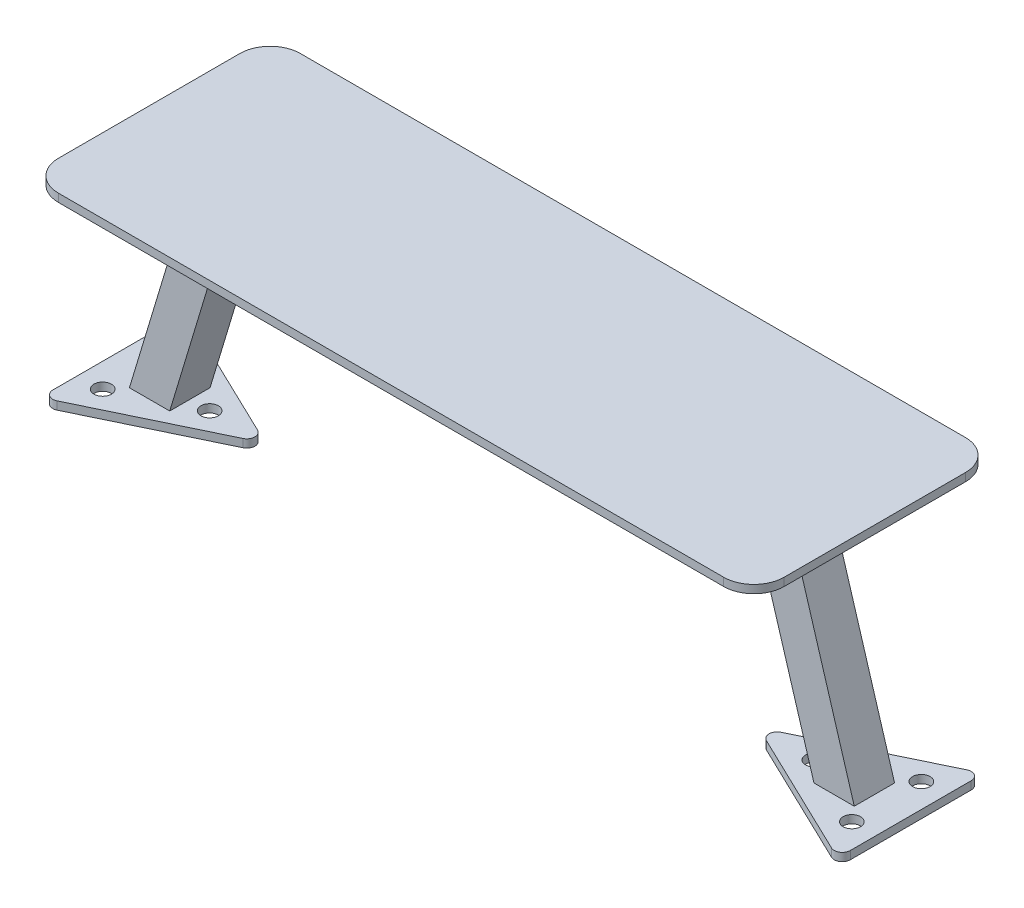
ISO-10303-21;
HEADER;
FILE_DESCRIPTION(('STEP AP214'),'2;1');
FILE_NAME('part.step','',(''),(''),'','','');
FILE_SCHEMA(('AUTOMOTIVE_DESIGN { 1 0 10303 214 1 1 1 1 }'));
ENDSEC;
DATA;
#1=APPLICATION_CONTEXT('core data for automotive mechanical design processes');
#2=APPLICATION_PROTOCOL_DEFINITION('international standard','automotive_design',2000,#1);
#3=PRODUCT_CONTEXT('',#1,'mechanical');
#4=PRODUCT('Part','Part','',(#3));
#5=PRODUCT_RELATED_PRODUCT_CATEGORY('part','',(#4));
#6=PRODUCT_DEFINITION_FORMATION('','',#4);
#7=PRODUCT_DEFINITION_CONTEXT('part definition',#1,'design');
#8=PRODUCT_DEFINITION('design','',#6,#7);
#9=PRODUCT_DEFINITION_SHAPE('','',#8);
#10=(LENGTH_UNIT() NAMED_UNIT(*) SI_UNIT(.MILLI.,.METRE.));
#11=(NAMED_UNIT(*) PLANE_ANGLE_UNIT() SI_UNIT($,.RADIAN.));
#12=(NAMED_UNIT(*) SI_UNIT($,.STERADIAN.) SOLID_ANGLE_UNIT());
#13=UNCERTAINTY_MEASURE_WITH_UNIT(LENGTH_MEASURE(1.E-05),#10,'distance_accuracy_value','');
#14=(GEOMETRIC_REPRESENTATION_CONTEXT(3) GLOBAL_UNCERTAINTY_ASSIGNED_CONTEXT((#13)) GLOBAL_UNIT_ASSIGNED_CONTEXT((#10,
#11,#12)) REPRESENTATION_CONTEXT('',''));
#15=CARTESIAN_POINT('',(0.,0.,0.));
#16=DIRECTION('',(0.,0.,1.));
#17=DIRECTION('',(1.,0.,0.));
#18=AXIS2_PLACEMENT_3D('',#15,#16,#17);
#19=CARTESIAN_POINT('',(0.,-71.12,0.));
#20=DIRECTION('',(0.,1.,0.));
#21=DIRECTION('',(0.,0.,1.));
#22=AXIS2_PLACEMENT_3D('',#19,#20,#21);
#23=PLANE('',#22);
#24=CARTESIAN_POINT('',(-118.000000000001,-71.12,-10.9449999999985));
#25=DIRECTION('',(0.,1.,0.));
#26=DIRECTION('',(0.,0.,-1.));
#27=AXIS2_PLACEMENT_3D('',#24,#25,#26);
#28=CIRCLE('',#27,2.74999999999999);
#29=CARTESIAN_POINT('',(-118.000000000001,-71.12,-13.6949999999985));
#30=VERTEX_POINT('',#29);
#31=EDGE_CURVE('E156',#30,#30,#28,.T.);
#32=ORIENTED_EDGE('',*,*,#31,.F.);
#33=EDGE_LOOP('',(#32));
#34=FACE_BOUND('',#33,.T.);
#35=DIRECTION('',(0.,0.,1.));
#36=VECTOR('',#35,1.);
#37=CARTESIAN_POINT('',(-125.620000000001,-71.12,-23.0669633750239));
#38=LINE('',#37,#36);
#39=CARTESIAN_POINT('',(-125.620000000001,-71.12,-19.0263089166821));
#40=VERTEX_POINT('',#39);
#41=CARTESIAN_POINT('',(-125.620000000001,-71.12,19.0263089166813));
#42=VERTEX_POINT('',#41);
#43=EDGE_CURVE('E127',#40,#42,#38,.T.);
#44=ORIENTED_EDGE('',*,*,#43,.T.);
#45=CARTESIAN_POINT('',(-123.080000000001,-71.12,19.0263089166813));
#46=DIRECTION('',(0.,1.,0.));
#47=DIRECTION('',(0.,0.,1.));
#48=AXIS2_PLACEMENT_3D('',#45,#46,#47);
#49=CIRCLE('',#48,2.54);
#50=CARTESIAN_POINT('',(-121.978819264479,-71.12,21.3151953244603));
#51=VERTEX_POINT('',#50);
#52=EDGE_CURVE('E142',#42,#51,#49,.T.);
#53=ORIENTED_EDGE('',*,*,#52,.T.);
#54=DIRECTION('',(0.901136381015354,0.,-0.433535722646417));
#55=VECTOR('',#54,1.);
#56=CARTESIAN_POINT('',(-125.620000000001,-71.12,23.0669633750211));
#57=LINE('',#56,#55);
#58=CARTESIAN_POINT('',(-82.4312150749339,-71.12,2.28888640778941));
#59=VERTEX_POINT('',#58);
#60=EDGE_CURVE('E117',#51,#59,#57,.T.);
#61=ORIENTED_EDGE('',*,*,#60,.T.);
#62=CARTESIAN_POINT('',(-83.5323958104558,-71.12,1.04087745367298E-11));
#63=DIRECTION('',(0.,1.,0.));
#64=DIRECTION('',(0.,0.,1.));
#65=AXIS2_PLACEMENT_3D('',#62,#63,#64);
#66=CIRCLE('',#65,2.54);
#67=CARTESIAN_POINT('',(-82.4312150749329,-71.12,-2.2888864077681));
#68=VERTEX_POINT('',#67);
#69=EDGE_CURVE('E65',#59,#68,#66,.T.);
#70=ORIENTED_EDGE('',*,*,#69,.T.);
#71=DIRECTION('',(-0.901136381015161,0.,-0.433535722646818));
#72=VECTOR('',#71,1.);
#73=CARTESIAN_POINT('',(-77.6735937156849,-71.12,1.17128529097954E-11));
#74=LINE('',#73,#72);
#75=CARTESIAN_POINT('',(-121.978819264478,-71.12,-21.3151953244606));
#76=VERTEX_POINT('',#75);
#77=EDGE_CURVE('E124',#68,#76,#74,.T.);
#78=ORIENTED_EDGE('',*,*,#77,.T.);
#79=CARTESIAN_POINT('',(-123.080000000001,-71.12,-19.0263089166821));
#80=DIRECTION('',(0.,1.,0.));
#81=DIRECTION('',(0.,0.,1.));
#82=AXIS2_PLACEMENT_3D('',#79,#80,#81);
#83=CIRCLE('',#82,2.54);
#84=EDGE_CURVE('E140',#76,#40,#83,.T.);
#85=ORIENTED_EDGE('',*,*,#84,.T.);
#86=EDGE_LOOP('',(#44,#53,#61,#70,#78,#85));
#87=FACE_BOUND('',#86,.T.);
#88=CARTESIAN_POINT('',(-118.000000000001,-71.12,10.9450000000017));
#89=DIRECTION('',(0.,1.,0.));
#90=DIRECTION('',(0.,0.,-1.));
#91=AXIS2_PLACEMENT_3D('',#88,#89,#90);
#92=CIRCLE('',#91,2.75000000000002);
#93=CARTESIAN_POINT('',(-118.000000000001,-71.12,8.19500000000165));
#94=VERTEX_POINT('',#93);
#95=EDGE_CURVE('E147',#94,#94,#92,.T.);
#96=ORIENTED_EDGE('',*,*,#95,.F.);
#97=EDGE_LOOP('',(#96));
#98=FACE_BOUND('',#97,.T.);
#99=CARTESIAN_POINT('',(-95.2499999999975,-71.12,7.80625564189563E-12));
#100=DIRECTION('',(0.,1.,0.));
#101=DIRECTION('',(0.,0.,-1.));
#102=AXIS2_PLACEMENT_3D('',#99,#100,#101);
#103=CIRCLE('',#102,2.75000000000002);
#104=CARTESIAN_POINT('',(-95.2499999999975,-71.12,-2.74999999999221));
#105=VERTEX_POINT('',#104);
#106=EDGE_CURVE('E161',#105,#105,#103,.T.);
#107=ORIENTED_EDGE('',*,*,#106,.F.);
#108=EDGE_LOOP('',(#107));
#109=FACE_BOUND('',#108,.T.);
#110=ADVANCED_FACE('F45',(#34,#87,#98,#109),#23,.T.);
#111=CARTESIAN_POINT('',(0.,-73.66,0.));
#112=DIRECTION('',(0.,1.,0.));
#113=DIRECTION('',(0.,0.,1.));
#114=AXIS2_PLACEMENT_3D('',#111,#112,#113);
#115=PLANE('',#114);
#116=DIRECTION('',(0.901136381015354,0.,-0.433535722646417));
#117=VECTOR('',#116,1.);
#118=CARTESIAN_POINT('',(-125.620000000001,-73.66,23.0669633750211));
#119=LINE('',#118,#117);
#120=CARTESIAN_POINT('',(-121.978819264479,-73.66,21.3151953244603));
#121=VERTEX_POINT('',#120);
#122=CARTESIAN_POINT('',(-82.4312150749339,-73.66,2.28888640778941));
#123=VERTEX_POINT('',#122);
#124=EDGE_CURVE('E115',#121,#123,#119,.T.);
#125=ORIENTED_EDGE('',*,*,#124,.F.);
#126=CARTESIAN_POINT('',(-123.080000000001,-73.66,19.0263089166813));
#127=DIRECTION('',(0.,1.,0.));
#128=DIRECTION('',(0.,0.,1.));
#129=AXIS2_PLACEMENT_3D('',#126,#127,#128);
#130=CIRCLE('',#129,2.54);
#131=CARTESIAN_POINT('',(-125.620000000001,-73.66,19.0263089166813));
#132=VERTEX_POINT('',#131);
#133=EDGE_CURVE('E98',#121,#132,#130,.F.);
#134=ORIENTED_EDGE('',*,*,#133,.T.);
#135=DIRECTION('',(0.,0.,1.));
#136=VECTOR('',#135,1.);
#137=CARTESIAN_POINT('',(-125.620000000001,-73.66,-23.0669633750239));
#138=LINE('',#137,#136);
#139=CARTESIAN_POINT('',(-125.620000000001,-73.66,-19.0263089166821));
#140=VERTEX_POINT('',#139);
#141=EDGE_CURVE('E125',#140,#132,#138,.T.);
#142=ORIENTED_EDGE('',*,*,#141,.F.);
#143=CARTESIAN_POINT('',(-123.080000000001,-73.66,-19.0263089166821));
#144=DIRECTION('',(0.,1.,0.));
#145=DIRECTION('',(0.,0.,1.));
#146=AXIS2_PLACEMENT_3D('',#143,#144,#145);
#147=CIRCLE('',#146,2.54);
#148=CARTESIAN_POINT('',(-121.978819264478,-73.66,-21.3151953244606));
#149=VERTEX_POINT('',#148);
#150=EDGE_CURVE('E109',#140,#149,#147,.F.);
#151=ORIENTED_EDGE('',*,*,#150,.T.);
#152=DIRECTION('',(-0.901136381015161,0.,-0.433535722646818));
#153=VECTOR('',#152,1.);
#154=CARTESIAN_POINT('',(-77.6735937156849,-73.66,1.17128529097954E-11));
#155=LINE('',#154,#153);
#156=CARTESIAN_POINT('',(-82.4312150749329,-73.66,-2.2888864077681));
#157=VERTEX_POINT('',#156);
#158=EDGE_CURVE('E129',#157,#149,#155,.T.);
#159=ORIENTED_EDGE('',*,*,#158,.F.);
#160=CARTESIAN_POINT('',(-83.5323958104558,-73.66,1.04087745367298E-11));
#161=DIRECTION('',(0.,1.,0.));
#162=DIRECTION('',(0.,0.,1.));
#163=AXIS2_PLACEMENT_3D('',#160,#161,#162);
#164=CIRCLE('',#163,2.54);
#165=EDGE_CURVE('E118',#157,#123,#164,.F.);
#166=ORIENTED_EDGE('',*,*,#165,.T.);
#167=EDGE_LOOP('',(#125,#134,#142,#151,#159,#166));
#168=FACE_BOUND('',#167,.T.);
#169=CARTESIAN_POINT('',(-118.000000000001,-73.66,10.9450000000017));
#170=DIRECTION('',(0.,1.,0.));
#171=DIRECTION('',(0.,0.,-1.));
#172=AXIS2_PLACEMENT_3D('',#169,#170,#171);
#173=CIRCLE('',#172,2.75000000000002);
#174=CARTESIAN_POINT('',(-118.000000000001,-73.66,8.19500000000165));
#175=VERTEX_POINT('',#174);
#176=EDGE_CURVE('E149',#175,#175,#173,.T.);
#177=ORIENTED_EDGE('',*,*,#176,.T.);
#178=EDGE_LOOP('',(#177));
#179=FACE_BOUND('',#178,.T.);
#180=CARTESIAN_POINT('',(-118.000000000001,-73.66,-10.9449999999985));
#181=DIRECTION('',(0.,1.,0.));
#182=DIRECTION('',(0.,0.,-1.));
#183=AXIS2_PLACEMENT_3D('',#180,#181,#182);
#184=CIRCLE('',#183,2.74999999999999);
#185=CARTESIAN_POINT('',(-118.000000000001,-73.66,-13.6949999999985));
#186=VERTEX_POINT('',#185);
#187=EDGE_CURVE('E158',#186,#186,#184,.T.);
#188=ORIENTED_EDGE('',*,*,#187,.T.);
#189=EDGE_LOOP('',(#188));
#190=FACE_BOUND('',#189,.T.);
#191=CARTESIAN_POINT('',(-95.2499999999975,-73.66,7.80625564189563E-12));
#192=DIRECTION('',(0.,1.,0.));
#193=DIRECTION('',(0.,0.,-1.));
#194=AXIS2_PLACEMENT_3D('',#191,#192,#193);
#195=CIRCLE('',#194,2.75000000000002);
#196=CARTESIAN_POINT('',(-95.2499999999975,-73.66,-2.74999999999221));
#197=VERTEX_POINT('',#196);
#198=EDGE_CURVE('E164',#197,#197,#195,.T.);
#199=ORIENTED_EDGE('',*,*,#198,.T.);
#200=EDGE_LOOP('',(#199));
#201=FACE_BOUND('',#200,.T.);
#202=ADVANCED_FACE('F121',(#168,#179,#190,#201),#115,.F.);
#203=CARTESIAN_POINT('',(-77.6735937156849,-71.12,1.17128529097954E-11));
#204=DIRECTION('',(-0.433535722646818,0.,0.901136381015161));
#205=DIRECTION('',(0.901136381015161,0.,0.433535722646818));
#206=AXIS2_PLACEMENT_3D('',#203,#204,#205);
#207=PLANE('',#206);
#208=ORIENTED_EDGE('',*,*,#158,.T.);
#209=DIRECTION('',(0.,-1.,0.));
#210=VECTOR('',#209,1.);
#211=CARTESIAN_POINT('',(-121.978819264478,-71.12,-21.3151953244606));
#212=LINE('',#211,#210);
#213=EDGE_CURVE('E12',#149,#76,#212,.F.);
#214=ORIENTED_EDGE('',*,*,#213,.T.);
#215=ORIENTED_EDGE('',*,*,#77,.F.);
#216=DIRECTION('',(0.,-1.,0.));
#217=VECTOR('',#216,1.);
#218=CARTESIAN_POINT('',(-82.4312150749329,-71.12,-2.2888864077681));
#219=LINE('',#218,#217);
#220=EDGE_CURVE('E53',#68,#157,#219,.T.);
#221=ORIENTED_EDGE('',*,*,#220,.T.);
#222=EDGE_LOOP('',(#208,#214,#215,#221));
#223=FACE_BOUND('',#222,.T.);
#224=ADVANCED_FACE('F145',(#223),#207,.F.);
#225=CARTESIAN_POINT('',(-125.620000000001,-71.12,-23.0669633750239));
#226=DIRECTION('',(1.,0.,0.));
#227=DIRECTION('',(0.,0.,-1.));
#228=AXIS2_PLACEMENT_3D('',#225,#226,#227);
#229=PLANE('',#228);
#230=ORIENTED_EDGE('',*,*,#141,.T.);
#231=DIRECTION('',(0.,-1.,0.));
#232=VECTOR('',#231,1.);
#233=CARTESIAN_POINT('',(-125.620000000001,-71.12,19.0263089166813));
#234=LINE('',#233,#232);
#235=EDGE_CURVE('E103',#132,#42,#234,.F.);
#236=ORIENTED_EDGE('',*,*,#235,.T.);
#237=ORIENTED_EDGE('',*,*,#43,.F.);
#238=DIRECTION('',(0.,-1.,0.));
#239=VECTOR('',#238,1.);
#240=CARTESIAN_POINT('',(-125.620000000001,-71.12,-19.0263089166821));
#241=LINE('',#240,#239);
#242=EDGE_CURVE('E108',#40,#140,#241,.T.);
#243=ORIENTED_EDGE('',*,*,#242,.T.);
#244=EDGE_LOOP('',(#230,#236,#237,#243));
#245=FACE_BOUND('',#244,.T.);
#246=ADVANCED_FACE('F187',(#245),#229,.F.);
#247=CARTESIAN_POINT('',(-125.620000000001,-71.12,23.0669633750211));
#248=DIRECTION('',(-0.433535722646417,0.,-0.901136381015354));
#249=DIRECTION('',(-0.901136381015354,0.,0.433535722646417));
#250=AXIS2_PLACEMENT_3D('',#247,#248,#249);
#251=PLANE('',#250);
#252=ORIENTED_EDGE('',*,*,#60,.F.);
#253=DIRECTION('',(0.,-1.,0.));
#254=VECTOR('',#253,1.);
#255=CARTESIAN_POINT('',(-121.978819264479,-71.12,21.3151953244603));
#256=LINE('',#255,#254);
#257=EDGE_CURVE('E102',#51,#121,#256,.T.);
#258=ORIENTED_EDGE('',*,*,#257,.T.);
#259=ORIENTED_EDGE('',*,*,#124,.T.);
#260=DIRECTION('',(0.,-1.,0.));
#261=VECTOR('',#260,1.);
#262=CARTESIAN_POINT('',(-82.4312150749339,-71.12,2.28888640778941));
#263=LINE('',#262,#261);
#264=EDGE_CURVE('E119',#123,#59,#263,.F.);
#265=ORIENTED_EDGE('',*,*,#264,.T.);
#266=EDGE_LOOP('',(#252,#258,#259,#265));
#267=FACE_BOUND('',#266,.T.);
#268=ADVANCED_FACE('F114',(#267),#251,.F.);
#269=CARTESIAN_POINT('',(-118.000000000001,-71.12,10.9450000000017));
#270=DIRECTION('',(0.,-1.,0.));
#271=DIRECTION('',(0.,0.,-1.));
#272=AXIS2_PLACEMENT_3D('',#269,#270,#271);
#273=CYLINDRICAL_SURFACE('',#272,2.75000000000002);
#274=ORIENTED_EDGE('',*,*,#95,.T.);
#275=EDGE_LOOP('',(#274));
#276=FACE_BOUND('',#275,.T.);
#277=ORIENTED_EDGE('',*,*,#176,.F.);
#278=EDGE_LOOP('',(#277));
#279=FACE_BOUND('',#278,.T.);
#280=ADVANCED_FACE('F182',(#276,#279),#273,.F.);
#281=CARTESIAN_POINT('',(-118.000000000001,-71.12,-10.9449999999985));
#282=DIRECTION('',(0.,-1.,0.));
#283=DIRECTION('',(0.,0.,-1.));
#284=AXIS2_PLACEMENT_3D('',#281,#282,#283);
#285=CYLINDRICAL_SURFACE('',#284,2.74999999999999);
#286=ORIENTED_EDGE('',*,*,#31,.T.);
#287=EDGE_LOOP('',(#286));
#288=FACE_BOUND('',#287,.T.);
#289=ORIENTED_EDGE('',*,*,#187,.F.);
#290=EDGE_LOOP('',(#289));
#291=FACE_BOUND('',#290,.T.);
#292=ADVANCED_FACE('F208',(#288,#291),#285,.F.);
#293=CARTESIAN_POINT('',(-95.2499999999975,-71.12,7.80625564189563E-12));
#294=DIRECTION('',(0.,-1.,0.));
#295=DIRECTION('',(0.,0.,-1.));
#296=AXIS2_PLACEMENT_3D('',#293,#294,#295);
#297=CYLINDRICAL_SURFACE('',#296,2.75000000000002);
#298=ORIENTED_EDGE('',*,*,#106,.T.);
#299=EDGE_LOOP('',(#298));
#300=FACE_BOUND('',#299,.T.);
#301=ORIENTED_EDGE('',*,*,#198,.F.);
#302=EDGE_LOOP('',(#301));
#303=FACE_BOUND('',#302,.T.);
#304=ADVANCED_FACE('F170',(#300,#303),#297,.F.);
#305=CARTESIAN_POINT('',(-123.080000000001,-71.12,19.0263089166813));
#306=DIRECTION('',(0.,-1.,0.));
#307=DIRECTION('',(0.,0.,-1.));
#308=AXIS2_PLACEMENT_3D('',#305,#306,#307);
#309=CYLINDRICAL_SURFACE('',#308,2.54);
#310=ORIENTED_EDGE('',*,*,#52,.F.);
#311=ORIENTED_EDGE('',*,*,#235,.F.);
#312=ORIENTED_EDGE('',*,*,#133,.F.);
#313=ORIENTED_EDGE('',*,*,#257,.F.);
#314=EDGE_LOOP('',(#310,#311,#312,#313));
#315=FACE_BOUND('',#314,.T.);
#316=ADVANCED_FACE('F101',(#315),#309,.T.);
#317=CARTESIAN_POINT('',(-123.080000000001,-71.12,-19.0263089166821));
#318=DIRECTION('',(0.,-1.,0.));
#319=DIRECTION('',(0.,0.,-1.));
#320=AXIS2_PLACEMENT_3D('',#317,#318,#319);
#321=CYLINDRICAL_SURFACE('',#320,2.54);
#322=ORIENTED_EDGE('',*,*,#84,.F.);
#323=ORIENTED_EDGE('',*,*,#213,.F.);
#324=ORIENTED_EDGE('',*,*,#150,.F.);
#325=ORIENTED_EDGE('',*,*,#242,.F.);
#326=EDGE_LOOP('',(#322,#323,#324,#325));
#327=FACE_BOUND('',#326,.T.);
#328=ADVANCED_FACE('F194',(#327),#321,.T.);
#329=CARTESIAN_POINT('',(-83.5323958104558,-71.12,1.04087745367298E-11));
#330=DIRECTION('',(0.,-1.,0.));
#331=DIRECTION('',(0.,0.,-1.));
#332=AXIS2_PLACEMENT_3D('',#329,#330,#331);
#333=CYLINDRICAL_SURFACE('',#332,2.54);
#334=ORIENTED_EDGE('',*,*,#69,.F.);
#335=ORIENTED_EDGE('',*,*,#264,.F.);
#336=ORIENTED_EDGE('',*,*,#165,.F.);
#337=ORIENTED_EDGE('',*,*,#220,.F.);
#338=EDGE_LOOP('',(#334,#335,#336,#337));
#339=FACE_BOUND('',#338,.T.);
#340=ADVANCED_FACE('F47',(#339),#333,.T.);
#341=CLOSED_SHELL('',(#110,#202,#224,#246,#268,#280,#292,#304,#316,#328,#340));
#342=MANIFOLD_SOLID_BREP('B2',#341);
#343=CARTESIAN_POINT('',(0.,0.,0.));
#344=DIRECTION('',(0.,1.,0.));
#345=DIRECTION('',(0.,0.,1.));
#346=AXIS2_PLACEMENT_3D('',#343,#344,#345);
#347=PLANE('',#346);
#348=DIRECTION('',(-1.,0.,0.));
#349=VECTOR('',#348,1.);
#350=CARTESIAN_POINT('',(80.0123683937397,0.,6.35));
#351=LINE('',#350,#349);
#352=CARTESIAN_POINT('',(92.7123683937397,0.,6.35));
#353=VERTEX_POINT('',#352);
#354=CARTESIAN_POINT('',(80.0123683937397,0.,6.35));
#355=VERTEX_POINT('',#354);
#356=EDGE_CURVE('E525',#353,#355,#351,.T.);
#357=ORIENTED_EDGE('',*,*,#356,.F.);
#358=DIRECTION('',(0.,0.,-1.));
#359=VECTOR('',#358,1.);
#360=CARTESIAN_POINT('',(92.7123683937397,0.,6.35));
#361=LINE('',#360,#359);
#362=CARTESIAN_POINT('',(92.7123683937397,0.,-6.35));
#363=VERTEX_POINT('',#362);
#364=EDGE_CURVE('E535',#353,#363,#361,.T.);
#365=ORIENTED_EDGE('',*,*,#364,.T.);
#366=DIRECTION('',(-1.,0.,0.));
#367=VECTOR('',#366,1.);
#368=CARTESIAN_POINT('',(80.0123683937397,0.,-6.35));
#369=LINE('',#368,#367);
#370=CARTESIAN_POINT('',(80.0123683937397,0.,-6.35));
#371=VERTEX_POINT('',#370);
#372=EDGE_CURVE('E524',#363,#371,#369,.T.);
#373=ORIENTED_EDGE('',*,*,#372,.T.);
#374=DIRECTION('',(0.,0.,-1.));
#375=VECTOR('',#374,1.);
#376=CARTESIAN_POINT('',(80.0123683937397,0.,6.35));
#377=LINE('',#376,#375);
#378=EDGE_CURVE('E307',#355,#371,#377,.T.);
#379=ORIENTED_EDGE('',*,*,#378,.F.);
#380=EDGE_LOOP('',(#357,#365,#373,#379));
#381=FACE_BOUND('',#380,.T.);
#382=DIRECTION('',(1.,0.,0.));
#383=VECTOR('',#382,1.);
#384=CARTESIAN_POINT('',(-114.3,0.,38.1));
#385=LINE('',#384,#383);
#386=CARTESIAN_POINT('',(-104.775,0.,38.1));
#387=VERTEX_POINT('',#386);
#388=CARTESIAN_POINT('',(104.775,0.,38.1));
#389=VERTEX_POINT('',#388);
#390=EDGE_CURVE('E558',#387,#389,#385,.T.);
#391=ORIENTED_EDGE('',*,*,#390,.F.);
#392=CARTESIAN_POINT('',(-104.775,0.,28.575));
#393=DIRECTION('',(0.,1.,0.));
#394=DIRECTION('',(0.,0.,1.));
#395=AXIS2_PLACEMENT_3D('',#392,#393,#394);
#396=CIRCLE('',#395,9.525);
#397=CARTESIAN_POINT('',(-114.3,0.,28.575));
#398=VERTEX_POINT('',#397);
#399=EDGE_CURVE('E588',#387,#398,#396,.F.);
#400=ORIENTED_EDGE('',*,*,#399,.T.);
#401=DIRECTION('',(0.,0.,1.));
#402=VECTOR('',#401,1.);
#403=CARTESIAN_POINT('',(-114.3,0.,-38.1));
#404=LINE('',#403,#402);
#405=CARTESIAN_POINT('',(-114.3,0.,-28.575));
#406=VERTEX_POINT('',#405);
#407=EDGE_CURVE('E573',#406,#398,#404,.T.);
#408=ORIENTED_EDGE('',*,*,#407,.F.);
#409=CARTESIAN_POINT('',(-104.775,0.,-28.575));
#410=DIRECTION('',(0.,1.,0.));
#411=DIRECTION('',(0.,0.,1.));
#412=AXIS2_PLACEMENT_3D('',#409,#410,#411);
#413=CIRCLE('',#412,9.525);
#414=CARTESIAN_POINT('',(-104.775,0.,-38.1));
#415=VERTEX_POINT('',#414);
#416=EDGE_CURVE('E586',#406,#415,#413,.F.);
#417=ORIENTED_EDGE('',*,*,#416,.T.);
#418=DIRECTION('',(-1.,0.,0.));
#419=VECTOR('',#418,1.);
#420=CARTESIAN_POINT('',(-114.3,0.,-38.1));
#421=LINE('',#420,#419);
#422=CARTESIAN_POINT('',(104.775,0.,-38.1));
#423=VERTEX_POINT('',#422);
#424=EDGE_CURVE('E570',#423,#415,#421,.T.);
#425=ORIENTED_EDGE('',*,*,#424,.F.);
#426=CARTESIAN_POINT('',(104.775,0.,-28.575));
#427=DIRECTION('',(0.,1.,0.));
#428=DIRECTION('',(0.,0.,1.));
#429=AXIS2_PLACEMENT_3D('',#426,#427,#428);
#430=CIRCLE('',#429,9.525);
#431=CARTESIAN_POINT('',(114.3,0.,-28.575));
#432=VERTEX_POINT('',#431);
#433=EDGE_CURVE('E582',#423,#432,#430,.F.);
#434=ORIENTED_EDGE('',*,*,#433,.T.);
#435=DIRECTION('',(0.,0.,-1.));
#436=VECTOR('',#435,1.);
#437=CARTESIAN_POINT('',(114.3,0.,-38.1));
#438=LINE('',#437,#436);
#439=CARTESIAN_POINT('',(114.3,0.,28.575));
#440=VERTEX_POINT('',#439);
#441=EDGE_CURVE('E553',#440,#432,#438,.T.);
#442=ORIENTED_EDGE('',*,*,#441,.F.);
#443=CARTESIAN_POINT('',(104.775,0.,28.575));
#444=DIRECTION('',(0.,1.,0.));
#445=DIRECTION('',(0.,0.,1.));
#446=AXIS2_PLACEMENT_3D('',#443,#444,#445);
#447=CIRCLE('',#446,9.525);
#448=EDGE_CURVE('E584',#440,#389,#447,.F.);
#449=ORIENTED_EDGE('',*,*,#448,.T.);
#450=EDGE_LOOP('',(#391,#400,#408,#417,#425,#434,#442,#449));
#451=FACE_BOUND('',#450,.T.);
#452=DIRECTION('',(1.,0.,0.));
#453=VECTOR('',#452,1.);
#454=CARTESIAN_POINT('',(-80.0123683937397,0.,6.35));
#455=LINE('',#454,#453);
#456=CARTESIAN_POINT('',(-92.7123683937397,0.,6.35));
#457=VERTEX_POINT('',#456);
#458=CARTESIAN_POINT('',(-80.0123683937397,0.,6.35));
#459=VERTEX_POINT('',#458);
#460=EDGE_CURVE('E435',#457,#459,#455,.T.);
#461=ORIENTED_EDGE('',*,*,#460,.T.);
#462=DIRECTION('',(0.,0.,-1.));
#463=VECTOR('',#462,1.);
#464=CARTESIAN_POINT('',(-80.0123683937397,0.,6.35));
#465=LINE('',#464,#463);
#466=CARTESIAN_POINT('',(-80.0123683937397,0.,-6.35));
#467=VERTEX_POINT('',#466);
#468=EDGE_CURVE('E921',#459,#467,#465,.T.);
#469=ORIENTED_EDGE('',*,*,#468,.T.);
#470=DIRECTION('',(1.,0.,0.));
#471=VECTOR('',#470,1.);
#472=CARTESIAN_POINT('',(-80.0123683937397,0.,-6.35));
#473=LINE('',#472,#471);
#474=CARTESIAN_POINT('',(-92.7123683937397,0.,-6.35));
#475=VERTEX_POINT('',#474);
#476=EDGE_CURVE('E455',#475,#467,#473,.T.);
#477=ORIENTED_EDGE('',*,*,#476,.F.);
#478=DIRECTION('',(0.,0.,-1.));
#479=VECTOR('',#478,1.);
#480=CARTESIAN_POINT('',(-92.7123683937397,0.,6.35));
#481=LINE('',#480,#479);
#482=EDGE_CURVE('E450',#457,#475,#481,.T.);
#483=ORIENTED_EDGE('',*,*,#482,.F.);
#484=EDGE_LOOP('',(#461,#469,#477,#483));
#485=FACE_BOUND('',#484,.T.);
#486=ADVANCED_FACE('F284',(#381,#451,#485),#347,.F.);
#487=CARTESIAN_POINT('',(114.3,2.54,-38.1));
#488=DIRECTION('',(-1.,0.,0.));
#489=DIRECTION('',(0.,0.,1.));
#490=AXIS2_PLACEMENT_3D('',#487,#488,#489);
#491=PLANE('',#490);
#492=DIRECTION('',(0.,0.,-1.));
#493=VECTOR('',#492,1.);
#494=CARTESIAN_POINT('',(114.3,2.54,-38.1));
#495=LINE('',#494,#493);
#496=CARTESIAN_POINT('',(114.3,2.54,28.575));
#497=VERTEX_POINT('',#496);
#498=CARTESIAN_POINT('',(114.3,2.54,-28.575));
#499=VERTEX_POINT('',#498);
#500=EDGE_CURVE('E554',#497,#499,#495,.T.);
#501=ORIENTED_EDGE('',*,*,#500,.F.);
#502=DIRECTION('',(0.,-1.,0.));
#503=VECTOR('',#502,1.);
#504=CARTESIAN_POINT('',(114.3,2.54,28.575));
#505=LINE('',#504,#503);
#506=EDGE_CURVE('E43',#497,#440,#505,.T.);
#507=ORIENTED_EDGE('',*,*,#506,.T.);
#508=ORIENTED_EDGE('',*,*,#441,.T.);
#509=DIRECTION('',(0.,-1.,0.));
#510=VECTOR('',#509,1.);
#511=CARTESIAN_POINT('',(114.3,2.54,-28.575));
#512=LINE('',#511,#510);
#513=EDGE_CURVE('E292',#432,#499,#512,.F.);
#514=ORIENTED_EDGE('',*,*,#513,.T.);
#515=EDGE_LOOP('',(#501,#507,#508,#514));
#516=FACE_BOUND('',#515,.T.);
#517=ADVANCED_FACE('F610',(#516),#491,.F.);
#518=CARTESIAN_POINT('',(-114.3,2.54,-38.1));
#519=DIRECTION('',(0.,0.,1.));
#520=DIRECTION('',(1.,0.,0.));
#521=AXIS2_PLACEMENT_3D('',#518,#519,#520);
#522=PLANE('',#521);
#523=ORIENTED_EDGE('',*,*,#424,.T.);
#524=DIRECTION('',(0.,-1.,0.));
#525=VECTOR('',#524,1.);
#526=CARTESIAN_POINT('',(-104.775,2.54,-38.1));
#527=LINE('',#526,#525);
#528=CARTESIAN_POINT('',(-104.775,2.54,-38.1));
#529=VERTEX_POINT('',#528);
#530=EDGE_CURVE('E606',#415,#529,#527,.F.);
#531=ORIENTED_EDGE('',*,*,#530,.T.);
#532=DIRECTION('',(-1.,0.,0.));
#533=VECTOR('',#532,1.);
#534=CARTESIAN_POINT('',(-114.3,2.54,-38.1));
#535=LINE('',#534,#533);
#536=CARTESIAN_POINT('',(104.775,2.54,-38.1));
#537=VERTEX_POINT('',#536);
#538=EDGE_CURVE('E557',#537,#529,#535,.T.);
#539=ORIENTED_EDGE('',*,*,#538,.F.);
#540=DIRECTION('',(0.,-1.,0.));
#541=VECTOR('',#540,1.);
#542=CARTESIAN_POINT('',(104.775,2.54,-38.1));
#543=LINE('',#542,#541);
#544=EDGE_CURVE('E603',#537,#423,#543,.T.);
#545=ORIENTED_EDGE('',*,*,#544,.T.);
#546=EDGE_LOOP('',(#523,#531,#539,#545));
#547=FACE_BOUND('',#546,.T.);
#548=ADVANCED_FACE('F622',(#547),#522,.F.);
#549=CARTESIAN_POINT('',(-114.3,2.54,-38.1));
#550=DIRECTION('',(1.,0.,0.));
#551=DIRECTION('',(0.,0.,-1.));
#552=AXIS2_PLACEMENT_3D('',#549,#550,#551);
#553=PLANE('',#552);
#554=ORIENTED_EDGE('',*,*,#407,.T.);
#555=DIRECTION('',(0.,-1.,0.));
#556=VECTOR('',#555,1.);
#557=CARTESIAN_POINT('',(-114.3,2.54,28.575));
#558=LINE('',#557,#556);
#559=CARTESIAN_POINT('',(-114.3,2.54,28.575));
#560=VERTEX_POINT('',#559);
#561=EDGE_CURVE('E593',#398,#560,#558,.F.);
#562=ORIENTED_EDGE('',*,*,#561,.T.);
#563=DIRECTION('',(0.,0.,1.));
#564=VECTOR('',#563,1.);
#565=CARTESIAN_POINT('',(-114.3,2.54,-38.1));
#566=LINE('',#565,#564);
#567=CARTESIAN_POINT('',(-114.3,2.54,-28.575));
#568=VERTEX_POINT('',#567);
#569=EDGE_CURVE('E561',#568,#560,#566,.T.);
#570=ORIENTED_EDGE('',*,*,#569,.F.);
#571=DIRECTION('',(0.,-1.,0.));
#572=VECTOR('',#571,1.);
#573=CARTESIAN_POINT('',(-114.3,2.54,-28.575));
#574=LINE('',#573,#572);
#575=EDGE_CURVE('E590',#568,#406,#574,.T.);
#576=ORIENTED_EDGE('',*,*,#575,.T.);
#577=EDGE_LOOP('',(#554,#562,#570,#576));
#578=FACE_BOUND('',#577,.T.);
#579=ADVANCED_FACE('F633',(#578),#553,.F.);
#580=CARTESIAN_POINT('',(-114.3,2.54,38.1));
#581=DIRECTION('',(0.,0.,-1.));
#582=DIRECTION('',(-1.,0.,0.));
#583=AXIS2_PLACEMENT_3D('',#580,#581,#582);
#584=PLANE('',#583);
#585=DIRECTION('',(1.,0.,0.));
#586=VECTOR('',#585,1.);
#587=CARTESIAN_POINT('',(-114.3,2.54,38.1));
#588=LINE('',#587,#586);
#589=CARTESIAN_POINT('',(-104.775,2.54,38.1));
#590=VERTEX_POINT('',#589);
#591=CARTESIAN_POINT('',(104.775,2.54,38.1));
#592=VERTEX_POINT('',#591);
#593=EDGE_CURVE('E564',#590,#592,#588,.T.);
#594=ORIENTED_EDGE('',*,*,#593,.F.);
#595=DIRECTION('',(0.,-1.,0.));
#596=VECTOR('',#595,1.);
#597=CARTESIAN_POINT('',(-104.775,2.54,38.1));
#598=LINE('',#597,#596);
#599=EDGE_CURVE('E579',#590,#387,#598,.T.);
#600=ORIENTED_EDGE('',*,*,#599,.T.);
#601=ORIENTED_EDGE('',*,*,#390,.T.);
#602=DIRECTION('',(0.,-1.,0.));
#603=VECTOR('',#602,1.);
#604=CARTESIAN_POINT('',(104.775,2.54,38.1));
#605=LINE('',#604,#603);
#606=EDGE_CURVE('E567',#389,#592,#605,.F.);
#607=ORIENTED_EDGE('',*,*,#606,.T.);
#608=EDGE_LOOP('',(#594,#600,#601,#607));
#609=FACE_BOUND('',#608,.T.);
#610=ADVANCED_FACE('F641',(#609),#584,.F.);
#611=CARTESIAN_POINT('',(0.,2.54,0.));
#612=DIRECTION('',(0.,1.,0.));
#613=DIRECTION('',(0.,0.,1.));
#614=AXIS2_PLACEMENT_3D('',#611,#612,#613);
#615=PLANE('',#614);
#616=ORIENTED_EDGE('',*,*,#569,.T.);
#617=CARTESIAN_POINT('',(-104.775,2.54,28.575));
#618=DIRECTION('',(0.,1.,0.));
#619=DIRECTION('',(0.,0.,1.));
#620=AXIS2_PLACEMENT_3D('',#617,#618,#619);
#621=CIRCLE('',#620,9.525);
#622=EDGE_CURVE('E601',#560,#590,#621,.T.);
#623=ORIENTED_EDGE('',*,*,#622,.T.);
#624=ORIENTED_EDGE('',*,*,#593,.T.);
#625=CARTESIAN_POINT('',(104.775,2.54,28.575));
#626=DIRECTION('',(0.,1.,0.));
#627=DIRECTION('',(0.,0.,1.));
#628=AXIS2_PLACEMENT_3D('',#625,#626,#627);
#629=CIRCLE('',#628,9.525);
#630=EDGE_CURVE('E597',#592,#497,#629,.T.);
#631=ORIENTED_EDGE('',*,*,#630,.T.);
#632=ORIENTED_EDGE('',*,*,#500,.T.);
#633=CARTESIAN_POINT('',(104.775,2.54,-28.575));
#634=DIRECTION('',(0.,1.,0.));
#635=DIRECTION('',(0.,0.,1.));
#636=AXIS2_PLACEMENT_3D('',#633,#634,#635);
#637=CIRCLE('',#636,9.525);
#638=EDGE_CURVE('E595',#499,#537,#637,.T.);
#639=ORIENTED_EDGE('',*,*,#638,.T.);
#640=ORIENTED_EDGE('',*,*,#538,.T.);
#641=CARTESIAN_POINT('',(-104.775,2.54,-28.575));
#642=DIRECTION('',(0.,1.,0.));
#643=DIRECTION('',(0.,0.,1.));
#644=AXIS2_PLACEMENT_3D('',#641,#642,#643);
#645=CIRCLE('',#644,9.525);
#646=EDGE_CURVE('E599',#529,#568,#645,.T.);
#647=ORIENTED_EDGE('',*,*,#646,.T.);
#648=EDGE_LOOP('',(#616,#623,#624,#631,#632,#639,#640,#647));
#649=FACE_BOUND('',#648,.T.);
#650=ADVANCED_FACE('F616',(#649),#615,.T.);
#651=CARTESIAN_POINT('',(-104.775,2.54,28.575));
#652=DIRECTION('',(0.,-1.,0.));
#653=DIRECTION('',(0.,0.,-1.));
#654=AXIS2_PLACEMENT_3D('',#651,#652,#653);
#655=CYLINDRICAL_SURFACE('',#654,9.525);
#656=ORIENTED_EDGE('',*,*,#622,.F.);
#657=ORIENTED_EDGE('',*,*,#561,.F.);
#658=ORIENTED_EDGE('',*,*,#399,.F.);
#659=ORIENTED_EDGE('',*,*,#599,.F.);
#660=EDGE_LOOP('',(#656,#657,#658,#659));
#661=FACE_BOUND('',#660,.T.);
#662=ADVANCED_FACE('F639',(#661),#655,.T.);
#663=CARTESIAN_POINT('',(-104.775,2.54,-28.575));
#664=DIRECTION('',(0.,-1.,0.));
#665=DIRECTION('',(0.,0.,-1.));
#666=AXIS2_PLACEMENT_3D('',#663,#664,#665);
#667=CYLINDRICAL_SURFACE('',#666,9.525);
#668=ORIENTED_EDGE('',*,*,#646,.F.);
#669=ORIENTED_EDGE('',*,*,#530,.F.);
#670=ORIENTED_EDGE('',*,*,#416,.F.);
#671=ORIENTED_EDGE('',*,*,#575,.F.);
#672=EDGE_LOOP('',(#668,#669,#670,#671));
#673=FACE_BOUND('',#672,.T.);
#674=ADVANCED_FACE('F630',(#673),#667,.T.);
#675=CARTESIAN_POINT('',(104.775,2.54,28.575));
#676=DIRECTION('',(0.,-1.,0.));
#677=DIRECTION('',(0.,0.,-1.));
#678=AXIS2_PLACEMENT_3D('',#675,#676,#677);
#679=CYLINDRICAL_SURFACE('',#678,9.525);
#680=ORIENTED_EDGE('',*,*,#630,.F.);
#681=ORIENTED_EDGE('',*,*,#606,.F.);
#682=ORIENTED_EDGE('',*,*,#448,.F.);
#683=ORIENTED_EDGE('',*,*,#506,.F.);
#684=EDGE_LOOP('',(#680,#681,#682,#683));
#685=FACE_BOUND('',#684,.T.);
#686=ADVANCED_FACE('F644',(#685),#679,.T.);
#687=CARTESIAN_POINT('',(104.775,2.54,-28.575));
#688=DIRECTION('',(0.,-1.,0.));
#689=DIRECTION('',(0.,0.,-1.));
#690=AXIS2_PLACEMENT_3D('',#687,#688,#689);
#691=CYLINDRICAL_SURFACE('',#690,9.525);
#692=ORIENTED_EDGE('',*,*,#638,.F.);
#693=ORIENTED_EDGE('',*,*,#513,.F.);
#694=ORIENTED_EDGE('',*,*,#433,.F.);
#695=ORIENTED_EDGE('',*,*,#544,.F.);
#696=EDGE_LOOP('',(#692,#693,#694,#695));
#697=FACE_BOUND('',#696,.T.);
#698=ADVANCED_FACE('F286',(#697),#691,.T.);
#699=CARTESIAN_POINT('',(101.470148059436,-71.12,6.35));
#700=DIRECTION('',(0.957373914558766,0.288851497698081,0.));
#701=DIRECTION('',(-0.288851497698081,0.957373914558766,0.));
#702=AXIS2_PLACEMENT_3D('',#699,#700,#701);
#703=PLANE('',#702);
#704=DIRECTION('',(0.288851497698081,-0.957373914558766,0.));
#705=VECTOR('',#704,1.);
#706=CARTESIAN_POINT('',(101.470148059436,-71.12,-6.35));
#707=LINE('',#706,#705);
#708=CARTESIAN_POINT('',(101.470148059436,-71.12,-6.35));
#709=VERTEX_POINT('',#708);
#710=EDGE_CURVE('E538',#371,#709,#707,.T.);
#711=ORIENTED_EDGE('',*,*,#710,.T.);
#712=DIRECTION('',(0.,0.,-1.));
#713=VECTOR('',#712,1.);
#714=CARTESIAN_POINT('',(101.470148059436,-71.12,6.35));
#715=LINE('',#714,#713);
#716=CARTESIAN_POINT('',(101.470148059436,-71.12,6.35));
#717=VERTEX_POINT('',#716);
#718=EDGE_CURVE('E549',#717,#709,#715,.T.);
#719=ORIENTED_EDGE('',*,*,#718,.F.);
#720=DIRECTION('',(0.288851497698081,-0.957373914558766,0.));
#721=VECTOR('',#720,1.);
#722=CARTESIAN_POINT('',(101.470148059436,-71.12,6.35));
#723=LINE('',#722,#721);
#724=EDGE_CURVE('E528',#355,#717,#723,.T.);
#725=ORIENTED_EDGE('',*,*,#724,.F.);
#726=ORIENTED_EDGE('',*,*,#378,.T.);
#727=EDGE_LOOP('',(#711,#719,#725,#726));
#728=FACE_BOUND('',#727,.T.);
#729=ADVANCED_FACE('F650',(#728),#703,.F.);
#730=CARTESIAN_POINT('',(92.7123683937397,0.,6.35));
#731=DIRECTION('',(-0.957373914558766,-0.288851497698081,0.));
#732=DIRECTION('',(0.288851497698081,-0.957373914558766,0.));
#733=AXIS2_PLACEMENT_3D('',#730,#731,#732);
#734=PLANE('',#733);
#735=DIRECTION('',(-0.288851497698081,0.957373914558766,0.));
#736=VECTOR('',#735,1.);
#737=CARTESIAN_POINT('',(92.7123683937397,0.,-6.35));
#738=LINE('',#737,#736);
#739=CARTESIAN_POINT('',(114.170148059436,-71.12,-6.35));
#740=VERTEX_POINT('',#739);
#741=EDGE_CURVE('E529',#740,#363,#738,.T.);
#742=ORIENTED_EDGE('',*,*,#741,.T.);
#743=ORIENTED_EDGE('',*,*,#364,.F.);
#744=DIRECTION('',(-0.288851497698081,0.957373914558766,0.));
#745=VECTOR('',#744,1.);
#746=CARTESIAN_POINT('',(92.7123683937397,0.,6.35));
#747=LINE('',#746,#745);
#748=CARTESIAN_POINT('',(114.170148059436,-71.12,6.35));
#749=VERTEX_POINT('',#748);
#750=EDGE_CURVE('E533',#749,#353,#747,.T.);
#751=ORIENTED_EDGE('',*,*,#750,.F.);
#752=DIRECTION('',(0.,0.,-1.));
#753=VECTOR('',#752,1.);
#754=CARTESIAN_POINT('',(114.170148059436,-71.12,6.35));
#755=LINE('',#754,#753);
#756=EDGE_CURVE('E546',#749,#740,#755,.T.);
#757=ORIENTED_EDGE('',*,*,#756,.T.);
#758=EDGE_LOOP('',(#742,#743,#751,#757));
#759=FACE_BOUND('',#758,.T.);
#760=ADVANCED_FACE('F828',(#759),#734,.F.);
#761=CARTESIAN_POINT('',(0.,0.,6.35));
#762=DIRECTION('',(0.,0.,-1.));
#763=DIRECTION('',(-1.,0.,0.));
#764=AXIS2_PLACEMENT_3D('',#761,#762,#763);
#765=PLANE('',#764);
#766=ORIENTED_EDGE('',*,*,#356,.T.);
#767=ORIENTED_EDGE('',*,*,#724,.T.);
#768=DIRECTION('',(1.,0.,0.));
#769=VECTOR('',#768,1.);
#770=CARTESIAN_POINT('',(114.170148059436,-71.12,6.35));
#771=LINE('',#770,#769);
#772=EDGE_CURVE('E531',#717,#749,#771,.T.);
#773=ORIENTED_EDGE('',*,*,#772,.T.);
#774=ORIENTED_EDGE('',*,*,#750,.T.);
#775=EDGE_LOOP('',(#766,#767,#773,#774));
#776=FACE_BOUND('',#775,.T.);
#777=ADVANCED_FACE('F835',(#776),#765,.F.);
#778=CARTESIAN_POINT('',(0.,0.,-6.35));
#779=DIRECTION('',(0.,0.,-1.));
#780=DIRECTION('',(-1.,0.,0.));
#781=AXIS2_PLACEMENT_3D('',#778,#779,#780);
#782=PLANE('',#781);
#783=ORIENTED_EDGE('',*,*,#372,.F.);
#784=ORIENTED_EDGE('',*,*,#741,.F.);
#785=DIRECTION('',(1.,0.,0.));
#786=VECTOR('',#785,1.);
#787=CARTESIAN_POINT('',(114.170148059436,-71.12,-6.35));
#788=LINE('',#787,#786);
#789=EDGE_CURVE('E540',#709,#740,#788,.T.);
#790=ORIENTED_EDGE('',*,*,#789,.F.);
#791=ORIENTED_EDGE('',*,*,#710,.F.);
#792=EDGE_LOOP('',(#783,#784,#790,#791));
#793=FACE_BOUND('',#792,.T.);
#794=ADVANCED_FACE('F730',(#793),#782,.T.);
#795=CARTESIAN_POINT('',(0.,-71.12,0.));
#796=DIRECTION('',(0.,1.,0.));
#797=DIRECTION('',(0.,0.,1.));
#798=AXIS2_PLACEMENT_3D('',#795,#796,#797);
#799=PLANE('',#798);
#800=CARTESIAN_POINT('',(95.2499999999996,-71.12,7.8687056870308E-12));
#801=DIRECTION('',(0.,1.,0.));
#802=DIRECTION('',(0.,0.,1.));
#803=AXIS2_PLACEMENT_3D('',#800,#801,#802);
#804=CIRCLE('',#803,2.75000000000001);
#805=CARTESIAN_POINT('',(95.2499999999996,-71.12,2.75000000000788));
#806=VERTEX_POINT('',#805);
#807=EDGE_CURVE('E459',#806,#806,#804,.T.);
#808=ORIENTED_EDGE('',*,*,#807,.F.);
#809=EDGE_LOOP('',(#808));
#810=FACE_BOUND('',#809,.T.);
#811=CARTESIAN_POINT('',(118.000000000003,-71.12,-10.9449999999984));
#812=DIRECTION('',(0.,1.,0.));
#813=DIRECTION('',(0.,0.,1.));
#814=AXIS2_PLACEMENT_3D('',#811,#812,#813);
#815=CIRCLE('',#814,2.75000000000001);
#816=CARTESIAN_POINT('',(118.000000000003,-71.12,-8.19499999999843));
#817=VERTEX_POINT('',#816);
#818=EDGE_CURVE('E474',#817,#817,#815,.T.);
#819=ORIENTED_EDGE('',*,*,#818,.F.);
#820=EDGE_LOOP('',(#819));
#821=FACE_BOUND('',#820,.T.);
#822=DIRECTION('',(-0.901136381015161,0.,0.433535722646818));
#823=VECTOR('',#822,1.);
#824=CARTESIAN_POINT('',(125.620000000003,-71.12,-23.0669633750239));
#825=LINE('',#824,#823);
#826=CARTESIAN_POINT('',(121.97881926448,-71.12,-21.3151953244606));
#827=VERTEX_POINT('',#826);
#828=CARTESIAN_POINT('',(82.431215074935,-71.12,-2.28888640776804));
#829=VERTEX_POINT('',#828);
#830=EDGE_CURVE('E483',#827,#829,#825,.T.);
#831=ORIENTED_EDGE('',*,*,#830,.T.);
#832=CARTESIAN_POINT('',(83.5323958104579,-71.12,1.04768624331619E-11));
#833=DIRECTION('',(0.,1.,0.));
#834=DIRECTION('',(0.,0.,1.));
#835=AXIS2_PLACEMENT_3D('',#832,#833,#834);
#836=CIRCLE('',#835,2.54);
#837=CARTESIAN_POINT('',(82.431215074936,-71.12,2.28888640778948));
#838=VERTEX_POINT('',#837);
#839=EDGE_CURVE('E517',#829,#838,#836,.T.);
#840=ORIENTED_EDGE('',*,*,#839,.T.);
#841=DIRECTION('',(0.901136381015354,0.,0.433535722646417));
#842=VECTOR('',#841,1.);
#843=CARTESIAN_POINT('',(77.673593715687,-71.12,1.17753029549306E-11));
#844=LINE('',#843,#842);
#845=CARTESIAN_POINT('',(121.978819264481,-71.12,21.3151953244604));
#846=VERTEX_POINT('',#845);
#847=EDGE_CURVE('E487',#838,#846,#844,.T.);
#848=ORIENTED_EDGE('',*,*,#847,.T.);
#849=CARTESIAN_POINT('',(123.080000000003,-71.12,19.0263089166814));
#850=DIRECTION('',(0.,1.,0.));
#851=DIRECTION('',(0.,0.,1.));
#852=AXIS2_PLACEMENT_3D('',#849,#850,#851);
#853=CIRCLE('',#852,2.54);
#854=CARTESIAN_POINT('',(125.620000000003,-71.12,19.0263089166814));
#855=VERTEX_POINT('',#854);
#856=EDGE_CURVE('E513',#846,#855,#853,.T.);
#857=ORIENTED_EDGE('',*,*,#856,.T.);
#858=DIRECTION('',(0.,0.,-1.));
#859=VECTOR('',#858,1.);
#860=CARTESIAN_POINT('',(125.620000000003,-71.12,23.0669633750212));
#861=LINE('',#860,#859);
#862=CARTESIAN_POINT('',(125.620000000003,-71.12,-19.026308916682));
#863=VERTEX_POINT('',#862);
#864=EDGE_CURVE('E480',#855,#863,#861,.T.);
#865=ORIENTED_EDGE('',*,*,#864,.T.);
#866=CARTESIAN_POINT('',(123.080000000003,-71.12,-19.026308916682));
#867=DIRECTION('',(0.,1.,0.));
#868=DIRECTION('',(0.,0.,1.));
#869=AXIS2_PLACEMENT_3D('',#866,#867,#868);
#870=CIRCLE('',#869,2.54);
#871=EDGE_CURVE('E515',#863,#827,#870,.T.);
#872=ORIENTED_EDGE('',*,*,#871,.T.);
#873=EDGE_LOOP('',(#831,#840,#848,#857,#865,#872));
#874=FACE_BOUND('',#873,.T.);
#875=CARTESIAN_POINT('',(118.000000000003,-71.12,10.9450000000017));
#876=DIRECTION('',(0.,1.,0.));
#877=DIRECTION('',(0.,0.,1.));
#878=AXIS2_PLACEMENT_3D('',#875,#876,#877);
#879=CIRCLE('',#878,2.75);
#880=CARTESIAN_POINT('',(118.000000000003,-71.12,13.6950000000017));
#881=VERTEX_POINT('',#880);
#882=EDGE_CURVE('E468',#881,#881,#879,.T.);
#883=ORIENTED_EDGE('',*,*,#882,.F.);
#884=EDGE_LOOP('',(#883));
#885=FACE_BOUND('',#884,.T.);
#886=ORIENTED_EDGE('',*,*,#772,.F.);
#887=ORIENTED_EDGE('',*,*,#718,.T.);
#888=ORIENTED_EDGE('',*,*,#789,.T.);
#889=ORIENTED_EDGE('',*,*,#756,.F.);
#890=EDGE_LOOP('',(#886,#887,#888,#889));
#891=FACE_BOUND('',#890,.T.);
#892=ADVANCED_FACE('F723',(#810,#821,#874,#885,#891),#799,.T.);
#893=CARTESIAN_POINT('',(0.,-73.66,0.));
#894=DIRECTION('',(0.,1.,0.));
#895=DIRECTION('',(0.,0.,1.));
#896=AXIS2_PLACEMENT_3D('',#893,#894,#895);
#897=PLANE('',#896);
#898=DIRECTION('',(0.901136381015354,0.,0.433535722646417));
#899=VECTOR('',#898,1.);
#900=CARTESIAN_POINT('',(77.673593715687,-73.66,1.17753029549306E-11));
#901=LINE('',#900,#899);
#902=CARTESIAN_POINT('',(82.431215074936,-73.66,2.28888640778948));
#903=VERTEX_POINT('',#902);
#904=CARTESIAN_POINT('',(121.978819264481,-73.66,21.3151953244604));
#905=VERTEX_POINT('',#904);
#906=EDGE_CURVE('E484',#903,#905,#901,.T.);
#907=ORIENTED_EDGE('',*,*,#906,.F.);
#908=CARTESIAN_POINT('',(83.5323958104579,-73.66,1.04768624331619E-11));
#909=DIRECTION('',(0.,1.,0.));
#910=DIRECTION('',(0.,0.,1.));
#911=AXIS2_PLACEMENT_3D('',#908,#909,#910);
#912=CIRCLE('',#911,2.54);
#913=CARTESIAN_POINT('',(82.431215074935,-73.66,-2.28888640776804));
#914=VERTEX_POINT('',#913);
#915=EDGE_CURVE('E506',#903,#914,#912,.F.);
#916=ORIENTED_EDGE('',*,*,#915,.T.);
#917=DIRECTION('',(-0.901136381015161,0.,0.433535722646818));
#918=VECTOR('',#917,1.);
#919=CARTESIAN_POINT('',(125.620000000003,-73.66,-23.0669633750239));
#920=LINE('',#919,#918);
#921=CARTESIAN_POINT('',(121.97881926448,-73.66,-21.3151953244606));
#922=VERTEX_POINT('',#921);
#923=EDGE_CURVE('E493',#922,#914,#920,.T.);
#924=ORIENTED_EDGE('',*,*,#923,.F.);
#925=CARTESIAN_POINT('',(123.080000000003,-73.66,-19.026308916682));
#926=DIRECTION('',(0.,1.,0.));
#927=DIRECTION('',(0.,0.,1.));
#928=AXIS2_PLACEMENT_3D('',#925,#926,#927);
#929=CIRCLE('',#928,2.54);
#930=CARTESIAN_POINT('',(125.620000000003,-73.66,-19.026308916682));
#931=VERTEX_POINT('',#930);
#932=EDGE_CURVE('E504',#922,#931,#929,.F.);
#933=ORIENTED_EDGE('',*,*,#932,.T.);
#934=DIRECTION('',(0.,0.,-1.));
#935=VECTOR('',#934,1.);
#936=CARTESIAN_POINT('',(125.620000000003,-73.66,23.0669633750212));
#937=LINE('',#936,#935);
#938=CARTESIAN_POINT('',(125.620000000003,-73.66,19.0263089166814));
#939=VERTEX_POINT('',#938);
#940=EDGE_CURVE('E477',#939,#931,#937,.T.);
#941=ORIENTED_EDGE('',*,*,#940,.F.);
#942=CARTESIAN_POINT('',(123.080000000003,-73.66,19.0263089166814));
#943=DIRECTION('',(0.,1.,0.));
#944=DIRECTION('',(0.,0.,1.));
#945=AXIS2_PLACEMENT_3D('',#942,#943,#944);
#946=CIRCLE('',#945,2.54);
#947=EDGE_CURVE('E502',#939,#905,#946,.F.);
#948=ORIENTED_EDGE('',*,*,#947,.T.);
#949=EDGE_LOOP('',(#907,#916,#924,#933,#941,#948));
#950=FACE_BOUND('',#949,.T.);
#951=CARTESIAN_POINT('',(118.000000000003,-73.66,-10.9449999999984));
#952=DIRECTION('',(0.,1.,0.));
#953=DIRECTION('',(0.,0.,1.));
#954=AXIS2_PLACEMENT_3D('',#951,#952,#953);
#955=CIRCLE('',#954,2.75000000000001);
#956=CARTESIAN_POINT('',(118.000000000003,-73.66,-8.19499999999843));
#957=VERTEX_POINT('',#956);
#958=EDGE_CURVE('E471',#957,#957,#955,.T.);
#959=ORIENTED_EDGE('',*,*,#958,.T.);
#960=EDGE_LOOP('',(#959));
#961=FACE_BOUND('',#960,.T.);
#962=CARTESIAN_POINT('',(118.000000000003,-73.66,10.9450000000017));
#963=DIRECTION('',(0.,1.,0.));
#964=DIRECTION('',(0.,0.,1.));
#965=AXIS2_PLACEMENT_3D('',#962,#963,#964);
#966=CIRCLE('',#965,2.75);
#967=CARTESIAN_POINT('',(118.000000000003,-73.66,13.6950000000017));
#968=VERTEX_POINT('',#967);
#969=EDGE_CURVE('E466',#968,#968,#966,.T.);
#970=ORIENTED_EDGE('',*,*,#969,.T.);
#971=EDGE_LOOP('',(#970));
#972=FACE_BOUND('',#971,.T.);
#973=CARTESIAN_POINT('',(95.2499999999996,-73.66,7.8687056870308E-12));
#974=DIRECTION('',(0.,1.,0.));
#975=DIRECTION('',(0.,0.,1.));
#976=AXIS2_PLACEMENT_3D('',#973,#974,#975);
#977=CIRCLE('',#976,2.75000000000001);
#978=CARTESIAN_POINT('',(95.2499999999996,-73.66,2.75000000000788));
#979=VERTEX_POINT('',#978);
#980=EDGE_CURVE('E456',#979,#979,#977,.T.);
#981=ORIENTED_EDGE('',*,*,#980,.T.);
#982=EDGE_LOOP('',(#981));
#983=FACE_BOUND('',#982,.T.);
#984=ADVANCED_FACE('F729',(#950,#961,#972,#983),#897,.F.);
#985=CARTESIAN_POINT('',(125.620000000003,-71.12,23.0669633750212));
#986=DIRECTION('',(-1.,0.,0.));
#987=DIRECTION('',(0.,0.,1.));
#988=AXIS2_PLACEMENT_3D('',#985,#986,#987);
#989=PLANE('',#988);
#990=ORIENTED_EDGE('',*,*,#940,.T.);
#991=DIRECTION('',(0.,-1.,0.));
#992=VECTOR('',#991,1.);
#993=CARTESIAN_POINT('',(125.620000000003,-71.12,-19.026308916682));
#994=LINE('',#993,#992);
#995=EDGE_CURVE('E522',#931,#863,#994,.F.);
#996=ORIENTED_EDGE('',*,*,#995,.T.);
#997=ORIENTED_EDGE('',*,*,#864,.F.);
#998=DIRECTION('',(0.,-1.,0.));
#999=VECTOR('',#998,1.);
#1000=CARTESIAN_POINT('',(125.620000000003,-71.12,19.0263089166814));
#1001=LINE('',#1000,#999);
#1002=EDGE_CURVE('E519',#855,#939,#1001,.T.);
#1003=ORIENTED_EDGE('',*,*,#1002,.T.);
#1004=EDGE_LOOP('',(#990,#996,#997,#1003));
#1005=FACE_BOUND('',#1004,.T.);
#1006=ADVANCED_FACE('F740',(#1005),#989,.F.);
#1007=CARTESIAN_POINT('',(125.620000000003,-71.12,-23.0669633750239));
#1008=DIRECTION('',(0.433535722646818,0.,0.901136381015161));
#1009=DIRECTION('',(0.901136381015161,0.,-0.433535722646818));
#1010=AXIS2_PLACEMENT_3D('',#1007,#1008,#1009);
#1011=PLANE('',#1010);
#1012=ORIENTED_EDGE('',*,*,#923,.T.);
#1013=DIRECTION('',(0.,-1.,0.));
#1014=VECTOR('',#1013,1.);
#1015=CARTESIAN_POINT('',(82.431215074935,-71.12,-2.28888640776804));
#1016=LINE('',#1015,#1014);
#1017=EDGE_CURVE('E511',#914,#829,#1016,.F.);
#1018=ORIENTED_EDGE('',*,*,#1017,.T.);
#1019=ORIENTED_EDGE('',*,*,#830,.F.);
#1020=DIRECTION('',(0.,-1.,0.));
#1021=VECTOR('',#1020,1.);
#1022=CARTESIAN_POINT('',(121.97881926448,-71.12,-21.3151953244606));
#1023=LINE('',#1022,#1021);
#1024=EDGE_CURVE('E508',#827,#922,#1023,.T.);
#1025=ORIENTED_EDGE('',*,*,#1024,.T.);
#1026=EDGE_LOOP('',(#1012,#1018,#1019,#1025));
#1027=FACE_BOUND('',#1026,.T.);
#1028=ADVANCED_FACE('F749',(#1027),#1011,.F.);
#1029=CARTESIAN_POINT('',(77.673593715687,-71.12,1.17753029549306E-11));
#1030=DIRECTION('',(0.433535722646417,0.,-0.901136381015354));
#1031=DIRECTION('',(-0.901136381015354,0.,-0.433535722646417));
#1032=AXIS2_PLACEMENT_3D('',#1029,#1030,#1031);
#1033=PLANE('',#1032);
#1034=ORIENTED_EDGE('',*,*,#847,.F.);
#1035=DIRECTION('',(0.,-1.,0.));
#1036=VECTOR('',#1035,1.);
#1037=CARTESIAN_POINT('',(82.431215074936,-71.12,2.28888640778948));
#1038=LINE('',#1037,#1036);
#1039=EDGE_CURVE('E499',#838,#903,#1038,.T.);
#1040=ORIENTED_EDGE('',*,*,#1039,.T.);
#1041=ORIENTED_EDGE('',*,*,#906,.T.);
#1042=DIRECTION('',(0.,-1.,0.));
#1043=VECTOR('',#1042,1.);
#1044=CARTESIAN_POINT('',(121.978819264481,-71.12,21.3151953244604));
#1045=LINE('',#1044,#1043);
#1046=EDGE_CURVE('E490',#905,#846,#1045,.F.);
#1047=ORIENTED_EDGE('',*,*,#1046,.T.);
#1048=EDGE_LOOP('',(#1034,#1040,#1041,#1047));
#1049=FACE_BOUND('',#1048,.T.);
#1050=ADVANCED_FACE('F758',(#1049),#1033,.F.);
#1051=CARTESIAN_POINT('',(118.000000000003,-71.12,-10.9449999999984));
#1052=DIRECTION('',(0.,-1.,0.));
#1053=DIRECTION('',(0.,0.,-1.));
#1054=AXIS2_PLACEMENT_3D('',#1051,#1052,#1053);
#1055=CYLINDRICAL_SURFACE('',#1054,2.75000000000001);
#1056=ORIENTED_EDGE('',*,*,#818,.T.);
#1057=EDGE_LOOP('',(#1056));
#1058=FACE_BOUND('',#1057,.T.);
#1059=ORIENTED_EDGE('',*,*,#958,.F.);
#1060=EDGE_LOOP('',(#1059));
#1061=FACE_BOUND('',#1060,.T.);
#1062=ADVANCED_FACE('F767',(#1058,#1061),#1055,.F.);
#1063=CARTESIAN_POINT('',(118.000000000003,-71.12,10.9450000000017));
#1064=DIRECTION('',(0.,-1.,0.));
#1065=DIRECTION('',(0.,0.,-1.));
#1066=AXIS2_PLACEMENT_3D('',#1063,#1064,#1065);
#1067=CYLINDRICAL_SURFACE('',#1066,2.75);
#1068=ORIENTED_EDGE('',*,*,#882,.T.);
#1069=EDGE_LOOP('',(#1068));
#1070=FACE_BOUND('',#1069,.T.);
#1071=ORIENTED_EDGE('',*,*,#969,.F.);
#1072=EDGE_LOOP('',(#1071));
#1073=FACE_BOUND('',#1072,.T.);
#1074=ADVANCED_FACE('F776',(#1070,#1073),#1067,.F.);
#1075=CARTESIAN_POINT('',(95.2499999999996,-71.12,7.8687056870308E-12));
#1076=DIRECTION('',(0.,-1.,0.));
#1077=DIRECTION('',(0.,0.,-1.));
#1078=AXIS2_PLACEMENT_3D('',#1075,#1076,#1077);
#1079=CYLINDRICAL_SURFACE('',#1078,2.75000000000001);
#1080=ORIENTED_EDGE('',*,*,#807,.T.);
#1081=EDGE_LOOP('',(#1080));
#1082=FACE_BOUND('',#1081,.T.);
#1083=ORIENTED_EDGE('',*,*,#980,.F.);
#1084=EDGE_LOOP('',(#1083));
#1085=FACE_BOUND('',#1084,.T.);
#1086=ADVANCED_FACE('F785',(#1082,#1085),#1079,.F.);
#1087=CARTESIAN_POINT('',(83.5323958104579,-71.12,1.04768624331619E-11));
#1088=DIRECTION('',(0.,-1.,0.));
#1089=DIRECTION('',(0.,0.,-1.));
#1090=AXIS2_PLACEMENT_3D('',#1087,#1088,#1089);
#1091=CYLINDRICAL_SURFACE('',#1090,2.54);
#1092=ORIENTED_EDGE('',*,*,#839,.F.);
#1093=ORIENTED_EDGE('',*,*,#1017,.F.);
#1094=ORIENTED_EDGE('',*,*,#915,.F.);
#1095=ORIENTED_EDGE('',*,*,#1039,.F.);
#1096=EDGE_LOOP('',(#1092,#1093,#1094,#1095));
#1097=FACE_BOUND('',#1096,.T.);
#1098=ADVANCED_FACE('F794',(#1097),#1091,.T.);
#1099=CARTESIAN_POINT('',(123.080000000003,-71.12,-19.026308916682));
#1100=DIRECTION('',(0.,-1.,0.));
#1101=DIRECTION('',(0.,0.,-1.));
#1102=AXIS2_PLACEMENT_3D('',#1099,#1100,#1101);
#1103=CYLINDRICAL_SURFACE('',#1102,2.54);
#1104=ORIENTED_EDGE('',*,*,#871,.F.);
#1105=ORIENTED_EDGE('',*,*,#995,.F.);
#1106=ORIENTED_EDGE('',*,*,#932,.F.);
#1107=ORIENTED_EDGE('',*,*,#1024,.F.);
#1108=EDGE_LOOP('',(#1104,#1105,#1106,#1107));
#1109=FACE_BOUND('',#1108,.T.);
#1110=ADVANCED_FACE('F803',(#1109),#1103,.T.);
#1111=CARTESIAN_POINT('',(123.080000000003,-71.12,19.0263089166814));
#1112=DIRECTION('',(0.,-1.,0.));
#1113=DIRECTION('',(0.,0.,-1.));
#1114=AXIS2_PLACEMENT_3D('',#1111,#1112,#1113);
#1115=CYLINDRICAL_SURFACE('',#1114,2.54);
#1116=ORIENTED_EDGE('',*,*,#856,.F.);
#1117=ORIENTED_EDGE('',*,*,#1046,.F.);
#1118=ORIENTED_EDGE('',*,*,#947,.F.);
#1119=ORIENTED_EDGE('',*,*,#1002,.F.);
#1120=EDGE_LOOP('',(#1116,#1117,#1118,#1119));
#1121=FACE_BOUND('',#1120,.T.);
#1122=ADVANCED_FACE('F812',(#1121),#1115,.T.);
#1123=CARTESIAN_POINT('',(-92.7123683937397,0.,6.35));
#1124=DIRECTION('',(-0.957373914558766,0.288851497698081,0.));
#1125=DIRECTION('',(-0.288851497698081,-0.957373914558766,0.));
#1126=AXIS2_PLACEMENT_3D('',#1123,#1124,#1125);
#1127=PLANE('',#1126);
#1128=DIRECTION('',(0.288851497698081,0.957373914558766,0.));
#1129=VECTOR('',#1128,1.);
#1130=CARTESIAN_POINT('',(-92.7123683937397,0.,-6.35));
#1131=LINE('',#1130,#1129);
#1132=CARTESIAN_POINT('',(-114.170148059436,-71.12,-6.35));
#1133=VERTEX_POINT('',#1132);
#1134=EDGE_CURVE('E299',#1133,#475,#1131,.T.);
#1135=ORIENTED_EDGE('',*,*,#1134,.F.);
#1136=DIRECTION('',(0.,0.,-1.));
#1137=VECTOR('',#1136,1.);
#1138=CARTESIAN_POINT('',(-114.170148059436,-71.12,6.35));
#1139=LINE('',#1138,#1137);
#1140=CARTESIAN_POINT('',(-114.170148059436,-71.12,6.35));
#1141=VERTEX_POINT('',#1140);
#1142=EDGE_CURVE('E452',#1141,#1133,#1139,.T.);
#1143=ORIENTED_EDGE('',*,*,#1142,.F.);
#1144=DIRECTION('',(0.288851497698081,0.957373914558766,0.));
#1145=VECTOR('',#1144,1.);
#1146=CARTESIAN_POINT('',(-92.7123683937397,0.,6.35));
#1147=LINE('',#1146,#1145);
#1148=EDGE_CURVE('E439',#1141,#457,#1147,.T.);
#1149=ORIENTED_EDGE('',*,*,#1148,.T.);
#1150=ORIENTED_EDGE('',*,*,#482,.T.);
#1151=EDGE_LOOP('',(#1135,#1143,#1149,#1150));
#1152=FACE_BOUND('',#1151,.T.);
#1153=ADVANCED_FACE('F449',(#1152),#1127,.T.);
#1154=CARTESIAN_POINT('',(-114.170148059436,-71.12,6.35));
#1155=DIRECTION('',(0.,-1.,0.));
#1156=DIRECTION('',(0.,0.,-1.));
#1157=AXIS2_PLACEMENT_3D('',#1154,#1155,#1156);
#1158=PLANE('',#1157);
#1159=DIRECTION('',(-1.,0.,0.));
#1160=VECTOR('',#1159,1.);
#1161=CARTESIAN_POINT('',(-114.170148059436,-71.12,-6.35));
#1162=LINE('',#1161,#1160);
#1163=CARTESIAN_POINT('',(-101.470148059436,-71.12,-6.35));
#1164=VERTEX_POINT('',#1163);
#1165=EDGE_CURVE('E923',#1164,#1133,#1162,.T.);
#1166=ORIENTED_EDGE('',*,*,#1165,.F.);
#1167=DIRECTION('',(0.,0.,-1.));
#1168=VECTOR('',#1167,1.);
#1169=CARTESIAN_POINT('',(-101.470148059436,-71.12,6.35));
#1170=LINE('',#1169,#1168);
#1171=CARTESIAN_POINT('',(-101.470148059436,-71.12,6.35));
#1172=VERTEX_POINT('',#1171);
#1173=EDGE_CURVE('E461',#1172,#1164,#1170,.T.);
#1174=ORIENTED_EDGE('',*,*,#1173,.F.);
#1175=DIRECTION('',(-1.,0.,0.));
#1176=VECTOR('',#1175,1.);
#1177=CARTESIAN_POINT('',(-114.170148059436,-71.12,6.35));
#1178=LINE('',#1177,#1176);
#1179=EDGE_CURVE('E453',#1172,#1141,#1178,.T.);
#1180=ORIENTED_EDGE('',*,*,#1179,.T.);
#1181=ORIENTED_EDGE('',*,*,#1142,.T.);
#1182=EDGE_LOOP('',(#1166,#1174,#1180,#1181));
#1183=FACE_BOUND('',#1182,.T.);
#1184=ADVANCED_FACE('F863',(#1183),#1158,.T.);
#1185=CARTESIAN_POINT('',(-101.470148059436,-71.12,6.35));
#1186=DIRECTION('',(0.957373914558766,-0.288851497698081,0.));
#1187=DIRECTION('',(0.288851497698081,0.957373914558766,0.));
#1188=AXIS2_PLACEMENT_3D('',#1185,#1186,#1187);
#1189=PLANE('',#1188);
#1190=DIRECTION('',(-0.288851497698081,-0.957373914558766,0.));
#1191=VECTOR('',#1190,1.);
#1192=CARTESIAN_POINT('',(-101.470148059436,-71.12,-6.35));
#1193=LINE('',#1192,#1191);
#1194=EDGE_CURVE('E446',#467,#1164,#1193,.T.);
#1195=ORIENTED_EDGE('',*,*,#1194,.F.);
#1196=ORIENTED_EDGE('',*,*,#468,.F.);
#1197=DIRECTION('',(-0.288851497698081,-0.957373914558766,0.));
#1198=VECTOR('',#1197,1.);
#1199=CARTESIAN_POINT('',(-101.470148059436,-71.12,6.35));
#1200=LINE('',#1199,#1198);
#1201=EDGE_CURVE('E442',#459,#1172,#1200,.T.);
#1202=ORIENTED_EDGE('',*,*,#1201,.T.);
#1203=ORIENTED_EDGE('',*,*,#1173,.T.);
#1204=EDGE_LOOP('',(#1195,#1196,#1202,#1203));
#1205=FACE_BOUND('',#1204,.T.);
#1206=ADVANCED_FACE('F871',(#1205),#1189,.T.);
#1207=CARTESIAN_POINT('',(0.,0.,6.35));
#1208=DIRECTION('',(0.,0.,-1.));
#1209=DIRECTION('',(1.,0.,0.));
#1210=AXIS2_PLACEMENT_3D('',#1207,#1208,#1209);
#1211=PLANE('',#1210);
#1212=ORIENTED_EDGE('',*,*,#460,.F.);
#1213=ORIENTED_EDGE('',*,*,#1148,.F.);
#1214=ORIENTED_EDGE('',*,*,#1179,.F.);
#1215=ORIENTED_EDGE('',*,*,#1201,.F.);
#1216=EDGE_LOOP('',(#1212,#1213,#1214,#1215));
#1217=FACE_BOUND('',#1216,.T.);
#1218=ADVANCED_FACE('F437',(#1217),#1211,.F.);
#1219=CARTESIAN_POINT('',(0.,0.,-6.35));
#1220=DIRECTION('',(0.,0.,-1.));
#1221=DIRECTION('',(1.,0.,0.));
#1222=AXIS2_PLACEMENT_3D('',#1219,#1220,#1221);
#1223=PLANE('',#1222);
#1224=ORIENTED_EDGE('',*,*,#476,.T.);
#1225=ORIENTED_EDGE('',*,*,#1194,.T.);
#1226=ORIENTED_EDGE('',*,*,#1165,.T.);
#1227=ORIENTED_EDGE('',*,*,#1134,.T.);
#1228=EDGE_LOOP('',(#1224,#1225,#1226,#1227));
#1229=FACE_BOUND('',#1228,.T.);
#1230=ADVANCED_FACE('F888',(#1229),#1223,.T.);
#1231=CLOSED_SHELL('',(#486,#517,#548,#579,#610,#650,#662,#674,#686,#698,#729,#760,#777,#794,
#892,#984,#1006,#1028,#1050,#1062,#1074,#1086,#1098,#1110,#1122,#1153,#1184,#1206,#1218,#1230));
#1232=MANIFOLD_SOLID_BREP('B6',#1231);
#1233=ADVANCED_BREP_SHAPE_REPRESENTATION('',(#18,#342,#1232),#14);
#1234=SHAPE_DEFINITION_REPRESENTATION(#9,#1233);
ENDSEC;
END-ISO-10303-21;
